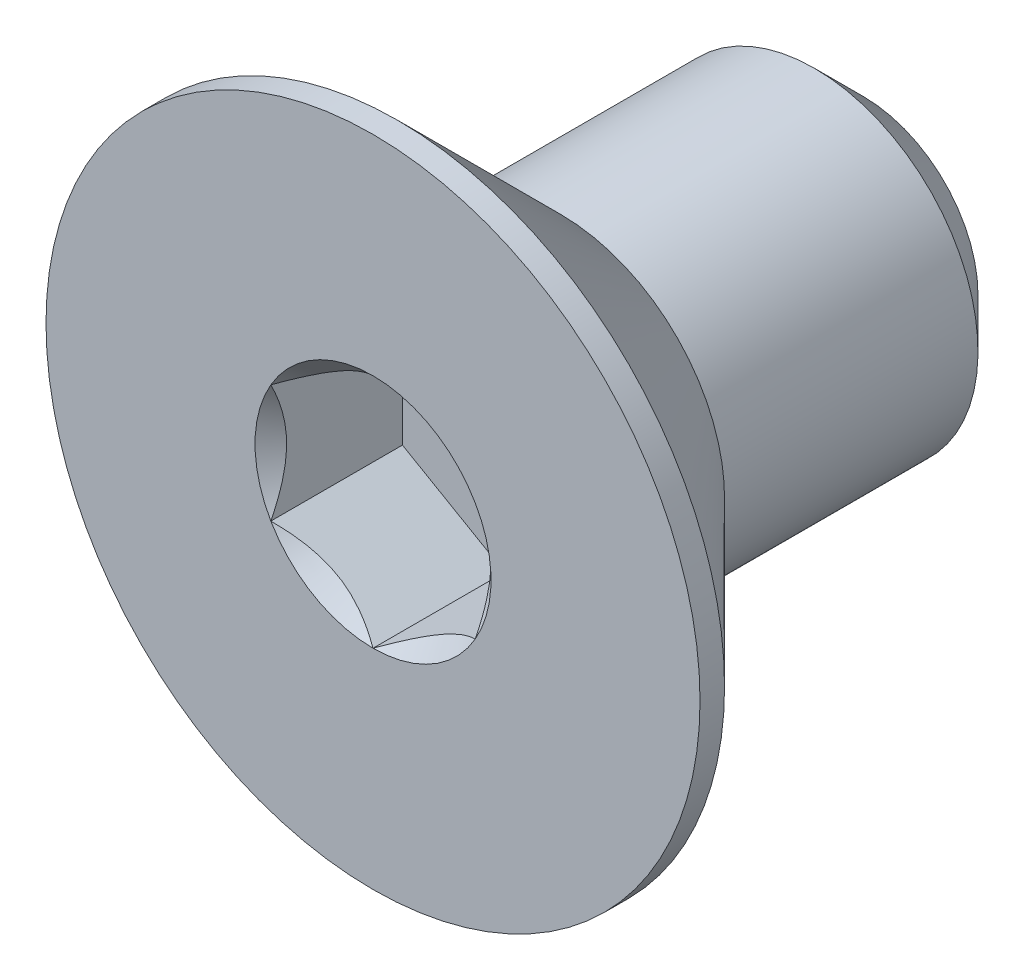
from build123d import *

# Parameters (mm, degrees)
SKETCH3_W          = 6
SKETCH3_H          = 2
CHAMFER1_SIZE      = 0.6
CUT_EXTRUDE1_DEPTH = 1.61


with BuildPart() as part:
    # Sketch3 → Revolve1 (revolve)
    with BuildSketch(Plane(origin=(0, 0, 0), x_dir=(0, 0, -1), z_dir=(1, 0, 0))):
        with Locations((0, 1)):
            Rectangle(SKETCH3_W, SKETCH3_H)
    revolve(axis=Axis((0, 0, -3), (0, 0, 1)))

    # Chamfer1
    chamfer1_edges = [part.edges().sort_by_distance(p)[0] for p in [
        (0, -2, -3),
    ]]
    chamfer(chamfer1_edges, length=CHAMFER1_SIZE)

    # Sketch6 → Revolve2 (revolve)
    with BuildSketch(Plane(origin=(0, 0, 0), x_dir=(0, 0, -1), z_dir=(1, 0, 0))):
        Polygon((-3, 4), (-2.7, 4), (-0.7, 2), (-0.7, 0), (-3, 0), align=None)
    revolve(axis=Axis((0, 0, -3), (0, 0, 1)))

    # Sketch8 → Cut-Extrude1 (cut)
    with BuildSketch(Plane.XY.offset(3)):
        Polygon((0, 1.443375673), (-1.25, 0.721687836), (-1.25, -0.721687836), (0, -1.443375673), (1.25, -0.721687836), (1.25, 0.721687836), align=None)
    extrude(amount=-CUT_EXTRUDE1_DEPTH, mode=Mode.SUBTRACT)

    # Cut-Extrude2 cone 1 section (on through the dimple's axis) → Cut-Extrude2 (revolve, cut)
    with BuildSketch(Plane(origin=(0, 0, 3), x_dir=(0, -1, 0), z_dir=(1, 0, 0))):
        Polygon((0, 0), (1.443375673, 0), (0, 1.443375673), align=None)
    revolve(axis=Axis((0, 0, 3), (0, 0, -1)), mode=Mode.SUBTRACT)


solid = part.part
